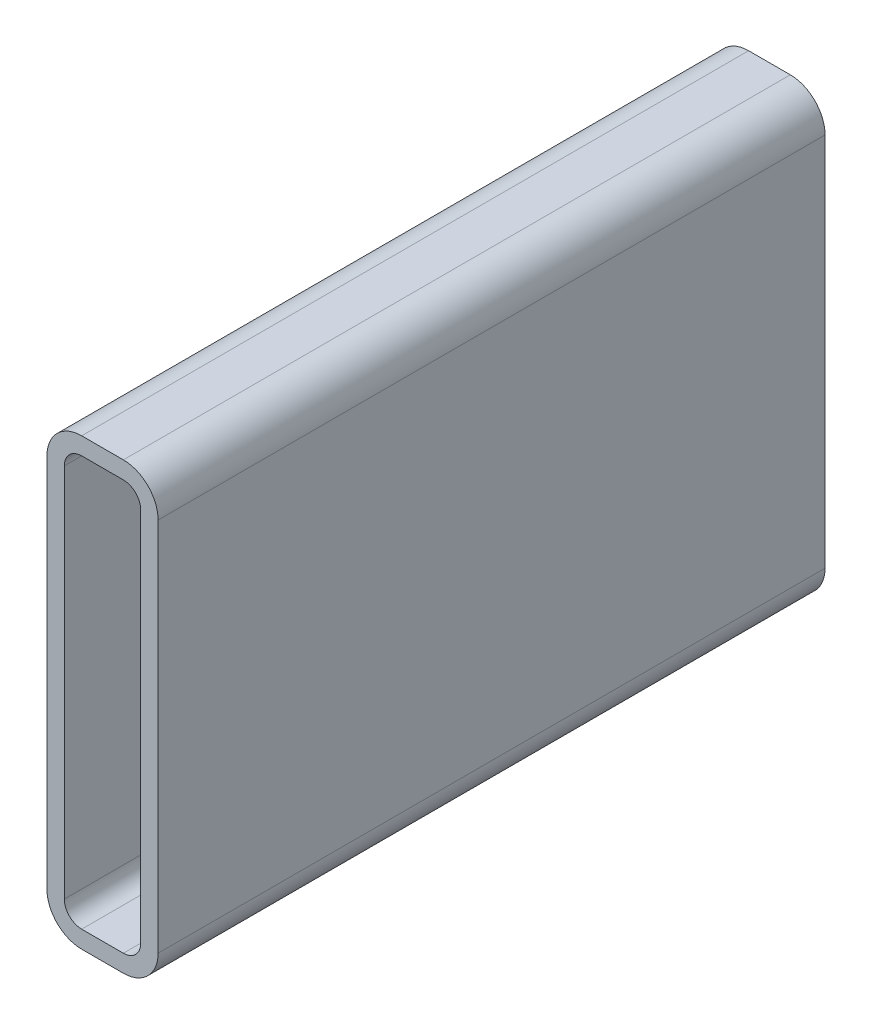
from build123d import *

# Parameters (mm, degrees)
BOSS_EXTRUDE1_DEPTH = 304.8


with BuildPart() as part:
    # Sketch1 → Boss-Extrude1 (new body)
    with BuildSketch(Plane.XY):
        with BuildLine():
            Line((15.875, 203.2), (34.925, 203.2))
            ThreePointArc((34.925, 203.2), (46.150320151, 198.550320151), (50.8, 187.325))
            Line((50.8, 187.325), (50.8, 15.875))
            ThreePointArc((50.8, 15.875), (46.150320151, 4.649679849), (34.925, 0))
            Line((34.925, 0), (15.875, 0))
            ThreePointArc((15.875, 0), (4.649679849, 4.649679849), (0, 15.875))
            Line((0, 15.875), (0, 187.325))
            ThreePointArc((0, 187.325), (4.649679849, 198.550320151), (15.875, 203.2))
        make_face()
        with BuildLine():
            Line((15.875, 195.2625), (34.925, 195.2625))
            ThreePointArc((34.925, 195.2625), (40.537660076, 192.937660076), (42.8625, 187.325))
            Line((42.8625, 187.325), (42.8625, 15.875))
            ThreePointArc((42.8625, 15.875), (40.537660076, 10.262339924), (34.925, 7.9375))
            Line((34.925, 7.9375), (15.875, 7.9375))
            ThreePointArc((15.875, 7.9375), (10.262339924, 10.262339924), (7.9375, 15.875))
            Line((7.9375, 15.875), (7.9375, 187.325))
            ThreePointArc((7.9375, 187.325), (10.262339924, 192.937660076), (15.875, 195.2625))
        make_face(mode=Mode.SUBTRACT)
    extrude(amount=BOSS_EXTRUDE1_DEPTH)


solid = part.part
